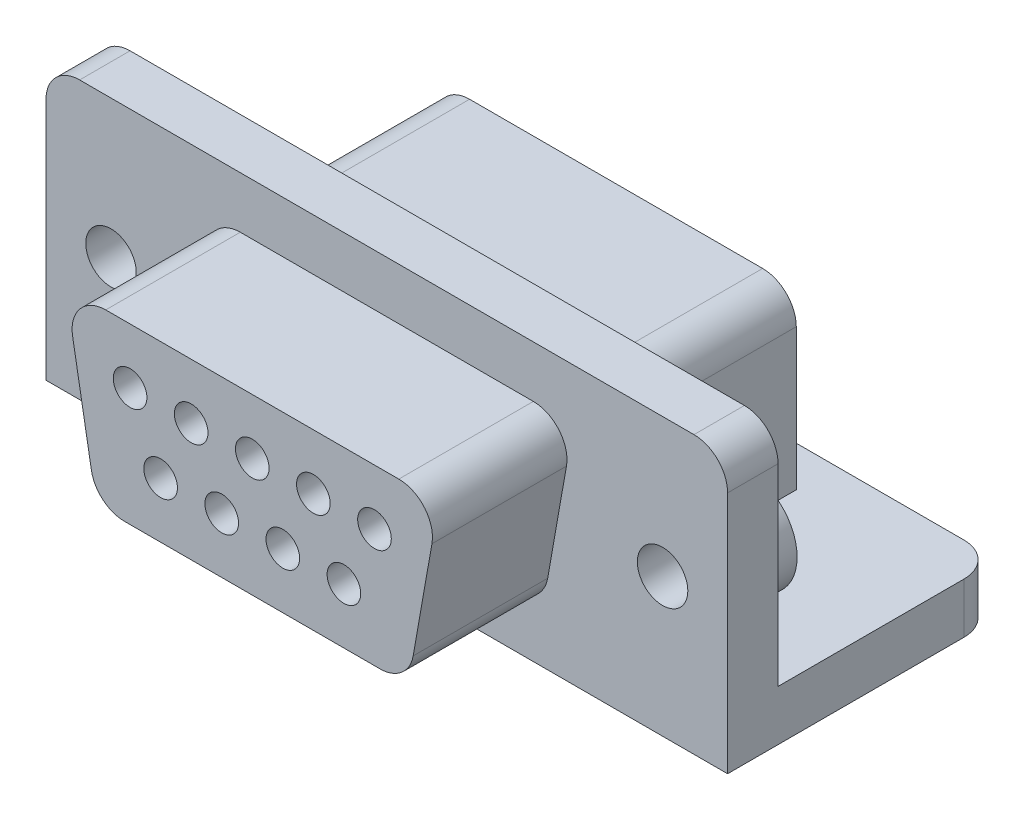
from build123d import *

# Parameters (mm, degrees)
SKETCH1_W           = 30.8864
SKETCH1_H           = 12.5476
BASE_EXTRUDE_DEPTH  = 2.286
FILLET1_R           = 1.524
BOSS_EXTRUDE1_DEPTH = 6.096
SKETCH3_R           = 1.143
CUT_EXTRUDE1_DEPTH  = 34.890606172
SKETCH4_W           = 30.8864
SKETCH4_H           = 2.286
BOSS_EXTRUDE2_DEPTH = 9.9568
FILLET2_R           = 1.524
SKETCH5_R           = 2.286
BOSS_EXTRUDE3_DEPTH = 1.524
SKETCH6_R           = 1.143
CUT_EXTRUDE2_DEPTH  = 35.778453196
BOSS_EXTRUDE4_DEPTH = 8.128
SKETCH8_R           = 0.762
CUT_EXTRUDE3_DEPTH  = 6.35


with BuildPart() as part:
    # Sketch1 → Base-Extrude (new body)
    with BuildSketch(Plane.XY):
        with Locations((15.4432, 6.2738)):
            Rectangle(SKETCH1_W, SKETCH1_H)
    extrude(amount=BASE_EXTRUDE_DEPTH)

    # Fillet1
    fillet1_edges = [part.edges().sort_by_distance(p)[0] for p in [
        (30.8864, 12.5476, 1.143),
        (0, 12.5476, 1.143),
    ]]
    fillet(fillet1_edges, radius=FILLET1_R)

    # Sketch2 → Boss-Extrude1 (add)
    with BuildSketch(Plane.XY.offset(2.286)):
        with BuildLine():
            Line((9.654301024, 2.3368), (21.232098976, 2.3368))
            ThreePointArc((21.232098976, 2.3368), (22.211707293, 2.693348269), (22.732945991, 3.596160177))
            Line((22.732945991, 3.596160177), (23.5839, 8.422160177))
            ThreePointArc((23.5839, 8.422160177), (23.250504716, 9.666408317), (22.083052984, 10.2108))
            Line((22.083052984, 10.2108), (8.803347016, 10.2108))
            ThreePointArc((8.803347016, 10.2108), (7.635895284, 9.666408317), (7.3025, 8.422160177))
            Line((7.3025, 8.422160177), (8.153454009, 3.596160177))
            ThreePointArc((8.153454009, 3.596160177), (8.674692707, 2.693348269), (9.654301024, 2.3368))
        make_face()
    extrude(amount=BOSS_EXTRUDE1_DEPTH)

    # Sketch3 → Cut-Extrude1 (cut, through all)
    with BuildSketch(Plane.XY.offset(2.286)):
        with Locations((27.94, 6.2738)):
            Circle(SKETCH3_R)
        with Locations((2.9464, 6.2738)):
            Circle(SKETCH3_R)
    extrude(amount=-CUT_EXTRUDE1_DEPTH, mode=Mode.SUBTRACT)

    # Sketch4 → Boss-Extrude2 (add)
    with BuildSketch(Plane(origin=(0, 0, 0), x_dir=(-1, 0, 0), z_dir=(0, 0, -1))):
        with Locations((-15.4432, 1.143)):
            Rectangle(SKETCH4_W, SKETCH4_H)
    extrude(amount=BOSS_EXTRUDE2_DEPTH)

    # Fillet2
    fillet2_edges = [part.edges().sort_by_distance(p)[0] for p in [
        (0, 1.143, -9.9568),
        (30.8864, 1.143, -9.9568),
    ]]
    fillet(fillet2_edges, radius=FILLET2_R)

    # Sketch5 → Boss-Extrude3 (add)
    with BuildSketch(Plane(origin=(0, 0, 0), x_dir=(-1, 0, 0), z_dir=(0, 0, -1))):
        with Locations(Location((-2.9464, 6.2738, 0), (0, 0, 180))):
            Circle(SKETCH5_R)
        with Locations(Location((-27.94, 6.2738, 0), (0, 0, 180))):
            Circle(SKETCH5_R)
    extrude(amount=BOSS_EXTRUDE3_DEPTH)

    # Sketch6 → Cut-Extrude2 (cut, through all)
    with BuildSketch(Plane(origin=(0, 0, -1.524), x_dir=(-1, 0, 0), z_dir=(0, 0, -1))):
        with Locations(Location((-27.94, 6.2738, 0), (0, 0, 180))):
            Circle(SKETCH6_R)
        with Locations(Location((-2.9464, 6.2738, 0), (0, 0, 180))):
            Circle(SKETCH6_R)
    extrude(amount=-CUT_EXTRUDE2_DEPTH, mode=Mode.SUBTRACT)

    # Sketch7 → Boss-Extrude4 (add)
    with BuildSketch(Plane(origin=(0, 0, 0), x_dir=(-1, 0, 0), z_dir=(0, 0, -1))):
        with BuildLine():
            Line((-22.0599, 10.2108), (-8.780194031, 10.2108))
            ThreePointArc((-8.780194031, 10.2108), (-7.702563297, 9.764430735), (-7.256194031, 8.6868))
            Line((-7.256194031, 8.6868), (-7.256194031, 2.286))
            Line((-7.256194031, 2.286), (-23.5839, 2.286))
            Line((-23.5839, 2.286), (-23.5839, 8.6868))
            ThreePointArc((-23.5839, 8.6868), (-23.137530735, 9.764430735), (-22.0599, 10.2108))
        make_face()
    extrude(amount=BOSS_EXTRUDE4_DEPTH)

    # Sketch8 → Cut-Extrude3 (cut)
    with BuildSketch(Plane.XY.offset(8.382)):
        with Locations((9.906, 7.6962)):
            Circle(SKETCH8_R)
        with Locations((11.2903, 4.8514)):
            Circle(SKETCH8_R)
        with Locations((12.6746, 7.6962)):
            Circle(SKETCH8_R)
        with Locations((14.0589, 4.8514)):
            Circle(SKETCH8_R)
        with Locations((15.4432, 7.6962)):
            Circle(SKETCH8_R)
        with Locations((16.8275, 4.8514)):
            Circle(SKETCH8_R)
        with Locations((18.2118, 7.6962)):
            Circle(SKETCH8_R)
        with Locations((19.5961, 4.8514)):
            Circle(SKETCH8_R)
        with Locations((20.9804, 7.6962)):
            Circle(SKETCH8_R)
    extrude(amount=-CUT_EXTRUDE3_DEPTH, mode=Mode.SUBTRACT)


solid = part.part
